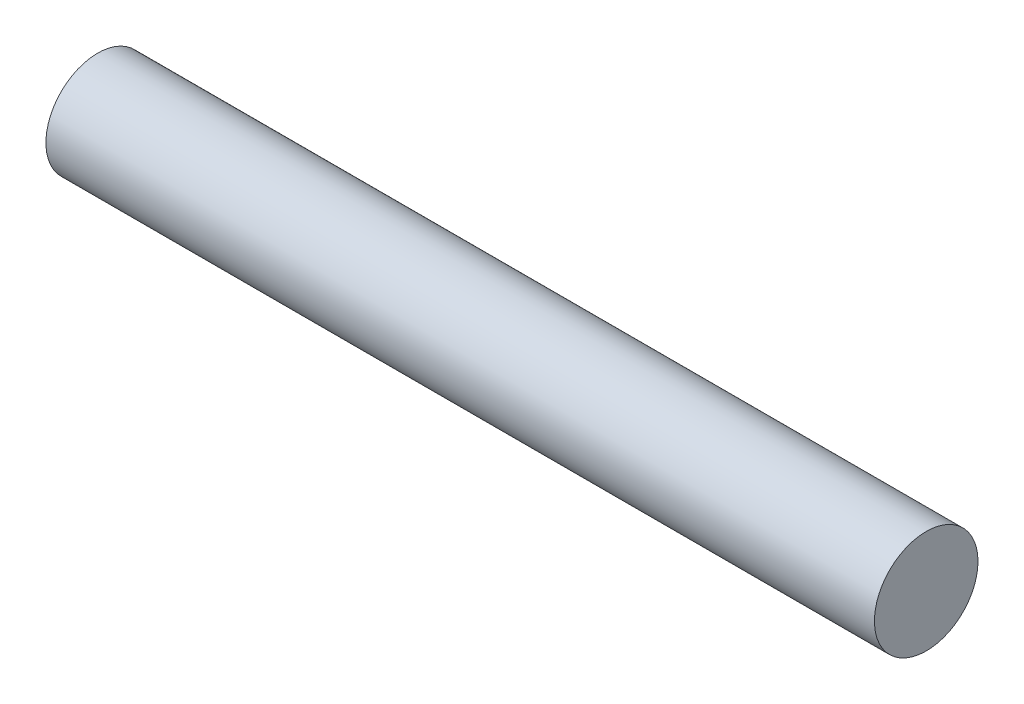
from build123d import *

# Parameters (mm, degrees)
SKETCH1_R      = 3.175
EXTRUDE1_DEPTH = 50.8


with BuildPart() as part:
    # Sketch1 → Extrude1 (new body)
    with BuildSketch(Plane(origin=(0, 0, 0), x_dir=(0, 0, -1), z_dir=(1, 0, 0))):
        Circle(SKETCH1_R)
    extrude(amount=EXTRUDE1_DEPTH)


solid = part.part
